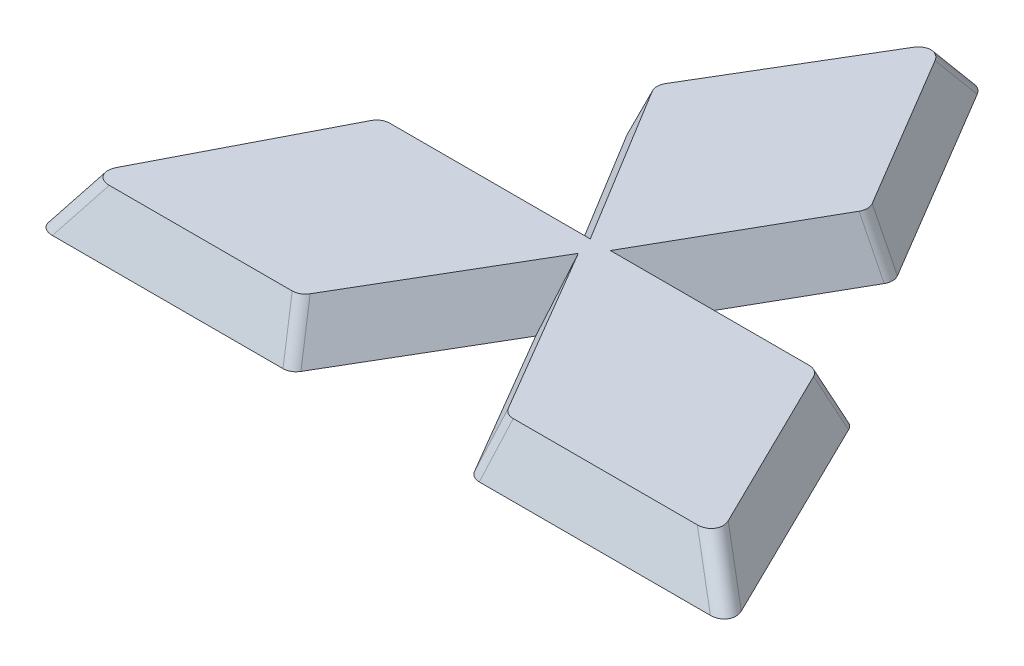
from build123d import *

# Parameters (mm, degrees)
FILLET1_R = 2


with BuildPart() as part:
    # Sketch2 → Loft7 section 0
    with BuildSketch(Plane(origin=(0, 7, 0), x_dir=(1, 0, 0), z_dir=(0, 1, 0))):
        with BuildLine():
            Line((0, 36.134153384), (-14.947528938, 11.019064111))
            Line((-14.947528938, 11.019064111), (-0.905899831, -12))
            Line((-0.905899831, -12), (-29.920779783, -12))
            Line((-29.920779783, -12), (-43.829870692, -39))
            Line((-43.829870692, -39), (-14.319079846, -39))
            Line((-14.319079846, -39), (0, -14.566649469))
            Line((0, -14.566649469), (14.319079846, -39))
            Line((14.319079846, -39), (43.935278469, -39))
            Line((43.935278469, -39), (30.680733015, -12))
            Line((30.680733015, -12), (1.886870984, -12))
            Line((1.886870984, -12), (14.978283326, 10.967390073))
            Line((14.978283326, 10.967390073), (0, 36.134153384))
        make_face()
    # Sketch1 → Loft7 section 1
    with BuildSketch(Plane(origin=(0, 0, 0), x_dir=(1, 0, 0), z_dir=(0, 1, 0))):
        with BuildLine():
            Line((-48.75, -42), (-12.6, -42))
            Line((-12.6, -42), (0, -20.5))
            Line((0, -20.5), (12.6, -42))
            Line((12.6, -42), (48.75, -42))
            Line((48.75, -42), (32.55, -9))
            Line((32.55, -9), (7.05, -9))
            Line((7.05, -9), (18.45, 11))
            Line((18.45, 11), (0, 42))
            Line((0, 42), (-18.45, 11))
            Line((-18.45, 11), (-6.25, -9))
            Line((-6.25, -9), (-31.75, -9))
            Line((-31.75, -9), (-48.75, -42))
        make_face()
    loft()

    # Fillet1
    fillet1_edges = [part.edges().sort_by_distance(p)[0] for p in [
        (0, 3.5, -39.067076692),
        (-16.698764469, 3.5, -11.009532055),
        (16.714141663, 3.5, -10.983695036),
        (31.615366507, 3.5, 10.5),
        (46.342639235, 3.5, 40.5),
        (-13.459539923, 3.5, 40.5),
        (13.459539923, 3.5, 40.5),
        (-46.289935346, 3.5, 40.5),
        (-30.835389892, 3.5, 10.5),
    ]]
    fillet(fillet1_edges, radius=FILLET1_R)


solid = part.part
